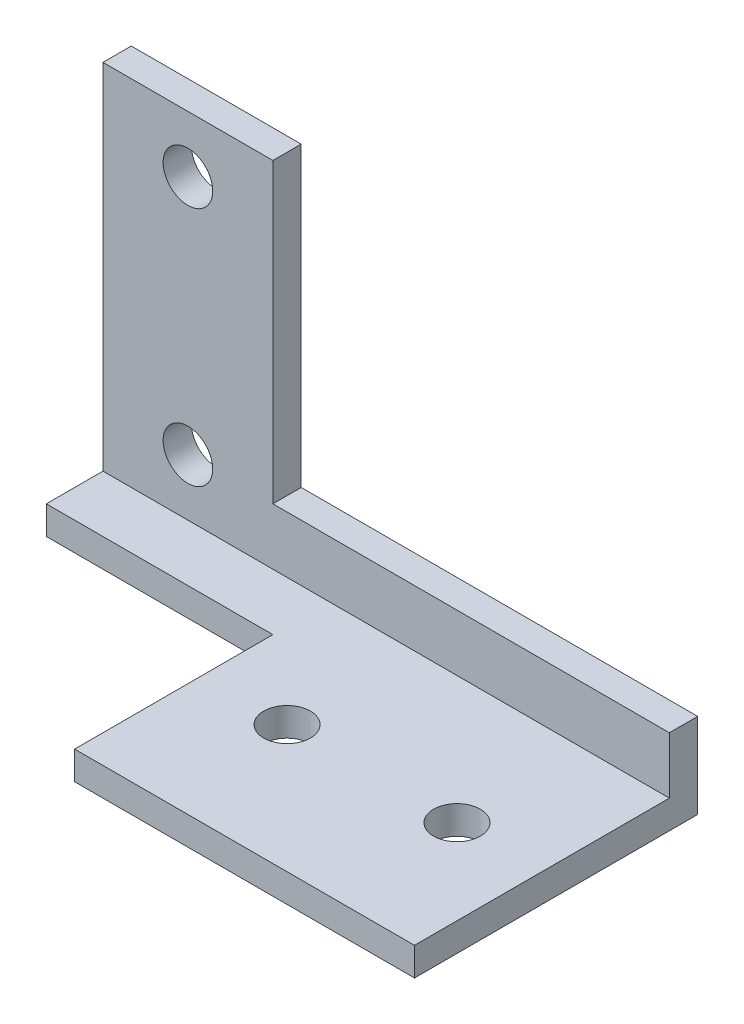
ISO-10303-21;
HEADER;
FILE_DESCRIPTION(('STEP AP214'),'2;1');
FILE_NAME('part.step','',(''),(''),'','','');
FILE_SCHEMA(('AUTOMOTIVE_DESIGN { 1 0 10303 214 1 1 1 1 }'));
ENDSEC;
DATA;
#1=APPLICATION_CONTEXT('core data for automotive mechanical design processes');
#2=APPLICATION_PROTOCOL_DEFINITION('international standard','automotive_design',2000,#1);
#3=PRODUCT_CONTEXT('',#1,'mechanical');
#4=PRODUCT('Part','Part','',(#3));
#5=PRODUCT_RELATED_PRODUCT_CATEGORY('part','',(#4));
#6=PRODUCT_DEFINITION_FORMATION('','',#4);
#7=PRODUCT_DEFINITION_CONTEXT('part definition',#1,'design');
#8=PRODUCT_DEFINITION('design','',#6,#7);
#9=PRODUCT_DEFINITION_SHAPE('','',#8);
#10=(LENGTH_UNIT() NAMED_UNIT(*) SI_UNIT(.MILLI.,.METRE.));
#11=(NAMED_UNIT(*) PLANE_ANGLE_UNIT() SI_UNIT($,.RADIAN.));
#12=(NAMED_UNIT(*) SI_UNIT($,.STERADIAN.) SOLID_ANGLE_UNIT());
#13=UNCERTAINTY_MEASURE_WITH_UNIT(LENGTH_MEASURE(1.E-05),#10,'distance_accuracy_value','');
#14=(GEOMETRIC_REPRESENTATION_CONTEXT(3) GLOBAL_UNCERTAINTY_ASSIGNED_CONTEXT((#13)) GLOBAL_UNIT_ASSIGNED_CONTEXT((#10,
#11,#12)) REPRESENTATION_CONTEXT('',''));
#15=CARTESIAN_POINT('',(0.,0.,0.));
#16=DIRECTION('',(0.,0.,1.));
#17=DIRECTION('',(1.,0.,0.));
#18=AXIS2_PLACEMENT_3D('',#15,#16,#17);
#19=CARTESIAN_POINT('',(40.,27.,2.));
#20=DIRECTION('',(0.,-1.,0.));
#21=DIRECTION('',(0.,0.,-1.));
#22=AXIS2_PLACEMENT_3D('',#19,#20,#21);
#23=PLANE('',#22);
#24=DIRECTION('',(-1.,0.,0.));
#25=VECTOR('',#24,1.);
#26=CARTESIAN_POINT('',(40.,27.,2.));
#27=LINE('',#26,#25);
#28=CARTESIAN_POINT('',(12.,27.,2.));
#29=VERTEX_POINT('',#28);
#30=CARTESIAN_POINT('',(0.,27.,2.));
#31=VERTEX_POINT('',#30);
#32=EDGE_CURVE('E139',#29,#31,#27,.T.);
#33=ORIENTED_EDGE('',*,*,#32,.F.);
#34=DIRECTION('',(0.,0.,1.));
#35=VECTOR('',#34,1.);
#36=CARTESIAN_POINT('',(12.,27.,-38.));
#37=LINE('',#36,#35);
#38=CARTESIAN_POINT('',(12.,27.,0.));
#39=VERTEX_POINT('',#38);
#40=EDGE_CURVE('E173',#39,#29,#37,.T.);
#41=ORIENTED_EDGE('',*,*,#40,.F.);
#42=DIRECTION('',(-1.,0.,0.));
#43=VECTOR('',#42,1.);
#44=CARTESIAN_POINT('',(40.,27.,0.));
#45=LINE('',#44,#43);
#46=CARTESIAN_POINT('',(0.,27.,0.));
#47=VERTEX_POINT('',#46);
#48=EDGE_CURVE('E192',#39,#47,#45,.T.);
#49=ORIENTED_EDGE('',*,*,#48,.T.);
#50=DIRECTION('',(0.,0.,1.));
#51=VECTOR('',#50,1.);
#52=CARTESIAN_POINT('',(0.,27.,2.));
#53=LINE('',#52,#51);
#54=EDGE_CURVE('E180',#47,#31,#53,.T.);
#55=ORIENTED_EDGE('',*,*,#54,.T.);
#56=EDGE_LOOP('',(#33,#41,#49,#55));
#57=FACE_BOUND('',#56,.T.);
#58=ADVANCED_FACE('F35',(#57),#23,.F.);
#59=CARTESIAN_POINT('',(40.,1.99999999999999,2.));
#60=DIRECTION('',(0.,0.,-1.));
#61=DIRECTION('',(0.,1.,0.));
#62=AXIS2_PLACEMENT_3D('',#59,#60,#61);
#63=PLANE('',#62);
#64=CARTESIAN_POINT('',(6.,6.,2.));
#65=DIRECTION('',(0.,0.,1.));
#66=DIRECTION('',(1.,0.,0.));
#67=AXIS2_PLACEMENT_3D('',#64,#65,#66);
#68=CIRCLE('',#67,1.75);
#69=CARTESIAN_POINT('',(7.75,6.,2.));
#70=VERTEX_POINT('',#69);
#71=EDGE_CURVE('E160',#70,#70,#68,.T.);
#72=ORIENTED_EDGE('',*,*,#71,.F.);
#73=EDGE_LOOP('',(#72));
#74=FACE_BOUND('',#73,.T.);
#75=CARTESIAN_POINT('',(6.,23.,2.));
#76=DIRECTION('',(0.,0.,1.));
#77=DIRECTION('',(1.,0.,0.));
#78=AXIS2_PLACEMENT_3D('',#75,#76,#77);
#79=CIRCLE('',#78,1.75);
#80=CARTESIAN_POINT('',(7.75,23.,2.));
#81=VERTEX_POINT('',#80);
#82=EDGE_CURVE('E152',#81,#81,#79,.T.);
#83=ORIENTED_EDGE('',*,*,#82,.F.);
#84=EDGE_LOOP('',(#83));
#85=FACE_BOUND('',#84,.T.);
#86=DIRECTION('',(0.,-1.,0.));
#87=VECTOR('',#86,1.);
#88=CARTESIAN_POINT('',(40.,1.99999999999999,2.));
#89=LINE('',#88,#87);
#90=CARTESIAN_POINT('',(40.,5.99999999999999,2.));
#91=VERTEX_POINT('',#90);
#92=CARTESIAN_POINT('',(40.,1.99999999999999,2.));
#93=VERTEX_POINT('',#92);
#94=EDGE_CURVE('E181',#91,#93,#89,.T.);
#95=ORIENTED_EDGE('',*,*,#94,.F.);
#96=DIRECTION('',(1.,0.,0.));
#97=VECTOR('',#96,1.);
#98=CARTESIAN_POINT('',(40.,6.,2.));
#99=LINE('',#98,#97);
#100=CARTESIAN_POINT('',(12.,5.99999999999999,2.));
#101=VERTEX_POINT('',#100);
#102=EDGE_CURVE('E59',#101,#91,#99,.T.);
#103=ORIENTED_EDGE('',*,*,#102,.F.);
#104=DIRECTION('',(0.,-1.,0.));
#105=VECTOR('',#104,1.);
#106=CARTESIAN_POINT('',(12.,27.,2.));
#107=LINE('',#106,#105);
#108=EDGE_CURVE('E169',#29,#101,#107,.T.);
#109=ORIENTED_EDGE('',*,*,#108,.F.);
#110=ORIENTED_EDGE('',*,*,#32,.T.);
#111=DIRECTION('',(0.,-1.,0.));
#112=VECTOR('',#111,1.);
#113=CARTESIAN_POINT('',(0.,1.99999999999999,2.));
#114=LINE('',#113,#112);
#115=CARTESIAN_POINT('',(0.,1.99999999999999,2.));
#116=VERTEX_POINT('',#115);
#117=EDGE_CURVE('E195',#31,#116,#114,.T.);
#118=ORIENTED_EDGE('',*,*,#117,.T.);
#119=DIRECTION('',(-1.,0.,0.));
#120=VECTOR('',#119,1.);
#121=CARTESIAN_POINT('',(40.,1.99999999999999,2.));
#122=LINE('',#121,#120);
#123=EDGE_CURVE('E135',#93,#116,#122,.T.);
#124=ORIENTED_EDGE('',*,*,#123,.F.);
#125=EDGE_LOOP('',(#95,#103,#109,#110,#118,#124));
#126=FACE_BOUND('',#125,.T.);
#127=ADVANCED_FACE('F231',(#74,#85,#126),#63,.F.);
#128=CARTESIAN_POINT('',(40.,2.,20.));
#129=DIRECTION('',(0.,-1.,0.));
#130=DIRECTION('',(0.,0.,-1.));
#131=AXIS2_PLACEMENT_3D('',#128,#129,#130);
#132=PLANE('',#131);
#133=CARTESIAN_POINT('',(34.,2.,11.));
#134=DIRECTION('',(0.,1.,0.));
#135=DIRECTION('',(0.,0.,1.));
#136=AXIS2_PLACEMENT_3D('',#133,#134,#135);
#137=CIRCLE('',#136,1.64999999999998);
#138=CARTESIAN_POINT('',(34.,2.,12.65));
#139=VERTEX_POINT('',#138);
#140=EDGE_CURVE('E268',#139,#139,#137,.T.);
#141=ORIENTED_EDGE('',*,*,#140,.F.);
#142=EDGE_LOOP('',(#141));
#143=FACE_BOUND('',#142,.T.);
#144=CARTESIAN_POINT('',(22.,2.,11.));
#145=DIRECTION('',(0.,1.,0.));
#146=DIRECTION('',(0.,0.,1.));
#147=AXIS2_PLACEMENT_3D('',#144,#145,#146);
#148=CIRCLE('',#147,1.64999999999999);
#149=CARTESIAN_POINT('',(22.,2.,12.65));
#150=VERTEX_POINT('',#149);
#151=EDGE_CURVE('E261',#150,#150,#148,.T.);
#152=ORIENTED_EDGE('',*,*,#151,.F.);
#153=EDGE_LOOP('',(#152));
#154=FACE_BOUND('',#153,.T.);
#155=DIRECTION('',(0.,0.,1.));
#156=VECTOR('',#155,1.);
#157=CARTESIAN_POINT('',(0.,2.,20.));
#158=LINE('',#157,#156);
#159=CARTESIAN_POINT('',(0.,2.,6.00000000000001));
#160=VERTEX_POINT('',#159);
#161=EDGE_CURVE('E197',#116,#160,#158,.T.);
#162=ORIENTED_EDGE('',*,*,#161,.T.);
#163=DIRECTION('',(-1.,0.,0.));
#164=VECTOR('',#163,1.);
#165=CARTESIAN_POINT('',(0.,1.99999999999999,6.00000000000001));
#166=LINE('',#165,#164);
#167=CARTESIAN_POINT('',(16.,1.99999999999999,6.00000000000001));
#168=VERTEX_POINT('',#167);
#169=EDGE_CURVE('E51',#168,#160,#166,.T.);
#170=ORIENTED_EDGE('',*,*,#169,.F.);
#171=DIRECTION('',(0.,0.,-1.));
#172=VECTOR('',#171,1.);
#173=CARTESIAN_POINT('',(16.,2.,20.));
#174=LINE('',#173,#172);
#175=CARTESIAN_POINT('',(16.,2.,20.));
#176=VERTEX_POINT('',#175);
#177=EDGE_CURVE('E117',#176,#168,#174,.T.);
#178=ORIENTED_EDGE('',*,*,#177,.F.);
#179=DIRECTION('',(-1.,0.,0.));
#180=VECTOR('',#179,1.);
#181=CARTESIAN_POINT('',(40.,2.,20.));
#182=LINE('',#181,#180);
#183=CARTESIAN_POINT('',(40.,2.,20.));
#184=VERTEX_POINT('',#183);
#185=EDGE_CURVE('E129',#184,#176,#182,.T.);
#186=ORIENTED_EDGE('',*,*,#185,.F.);
#187=DIRECTION('',(0.,0.,1.));
#188=VECTOR('',#187,1.);
#189=CARTESIAN_POINT('',(40.,2.,20.));
#190=LINE('',#189,#188);
#191=EDGE_CURVE('E183',#93,#184,#190,.T.);
#192=ORIENTED_EDGE('',*,*,#191,.F.);
#193=ORIENTED_EDGE('',*,*,#123,.T.);
#194=EDGE_LOOP('',(#162,#170,#178,#186,#192,#193));
#195=FACE_BOUND('',#194,.T.);
#196=ADVANCED_FACE('F127',(#143,#154,#195),#132,.F.);
#197=CARTESIAN_POINT('',(40.,0.,20.));
#198=DIRECTION('',(0.,0.,-1.));
#199=DIRECTION('',(-1.,0.,0.));
#200=AXIS2_PLACEMENT_3D('',#197,#198,#199);
#201=PLANE('',#200);
#202=ORIENTED_EDGE('',*,*,#185,.T.);
#203=DIRECTION('',(0.,1.,0.));
#204=VECTOR('',#203,1.);
#205=CARTESIAN_POINT('',(16.,-38.,20.));
#206=LINE('',#205,#204);
#207=CARTESIAN_POINT('',(16.,0.,20.));
#208=VERTEX_POINT('',#207);
#209=EDGE_CURVE('E113',#208,#176,#206,.T.);
#210=ORIENTED_EDGE('',*,*,#209,.F.);
#211=DIRECTION('',(-1.,0.,0.));
#212=VECTOR('',#211,1.);
#213=CARTESIAN_POINT('',(40.,0.,20.));
#214=LINE('',#213,#212);
#215=CARTESIAN_POINT('',(40.,0.,20.));
#216=VERTEX_POINT('',#215);
#217=EDGE_CURVE('E136',#216,#208,#214,.T.);
#218=ORIENTED_EDGE('',*,*,#217,.F.);
#219=DIRECTION('',(0.,-1.,0.));
#220=VECTOR('',#219,1.);
#221=CARTESIAN_POINT('',(40.,0.,20.));
#222=LINE('',#221,#220);
#223=EDGE_CURVE('E134',#184,#216,#222,.T.);
#224=ORIENTED_EDGE('',*,*,#223,.F.);
#225=EDGE_LOOP('',(#202,#210,#218,#224));
#226=FACE_BOUND('',#225,.T.);
#227=ADVANCED_FACE('F133',(#226),#201,.F.);
#228=CARTESIAN_POINT('',(40.,0.,0.));
#229=DIRECTION('',(0.,1.,0.));
#230=DIRECTION('',(0.,0.,1.));
#231=AXIS2_PLACEMENT_3D('',#228,#229,#230);
#232=PLANE('',#231);
#233=CARTESIAN_POINT('',(34.,0.,11.));
#234=DIRECTION('',(0.,1.,0.));
#235=DIRECTION('',(0.,0.,1.));
#236=AXIS2_PLACEMENT_3D('',#233,#234,#235);
#237=CIRCLE('',#236,1.65);
#238=CARTESIAN_POINT('',(34.,0.,12.65));
#239=VERTEX_POINT('',#238);
#240=EDGE_CURVE('E264',#239,#239,#237,.T.);
#241=ORIENTED_EDGE('',*,*,#240,.T.);
#242=EDGE_LOOP('',(#241));
#243=FACE_BOUND('',#242,.T.);
#244=CARTESIAN_POINT('',(22.,0.,11.));
#245=DIRECTION('',(0.,1.,0.));
#246=DIRECTION('',(0.,0.,1.));
#247=AXIS2_PLACEMENT_3D('',#244,#245,#246);
#248=CIRCLE('',#247,1.65);
#249=CARTESIAN_POINT('',(22.,0.,12.65));
#250=VERTEX_POINT('',#249);
#251=EDGE_CURVE('E259',#250,#250,#248,.T.);
#252=ORIENTED_EDGE('',*,*,#251,.T.);
#253=EDGE_LOOP('',(#252));
#254=FACE_BOUND('',#253,.T.);
#255=DIRECTION('',(0.,0.,-1.));
#256=VECTOR('',#255,1.);
#257=CARTESIAN_POINT('',(16.,0.,0.));
#258=LINE('',#257,#256);
#259=CARTESIAN_POINT('',(16.,0.,6.00000000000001));
#260=VERTEX_POINT('',#259);
#261=EDGE_CURVE('E11',#208,#260,#258,.T.);
#262=ORIENTED_EDGE('',*,*,#261,.T.);
#263=DIRECTION('',(-1.,0.,0.));
#264=VECTOR('',#263,1.);
#265=CARTESIAN_POINT('',(40.,0.,6.00000000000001));
#266=LINE('',#265,#264);
#267=CARTESIAN_POINT('',(0.,0.,6.00000000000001));
#268=VERTEX_POINT('',#267);
#269=EDGE_CURVE('E165',#260,#268,#266,.T.);
#270=ORIENTED_EDGE('',*,*,#269,.T.);
#271=DIRECTION('',(0.,0.,-1.));
#272=VECTOR('',#271,1.);
#273=CARTESIAN_POINT('',(0.,0.,0.));
#274=LINE('',#273,#272);
#275=CARTESIAN_POINT('',(0.,0.,0.));
#276=VERTEX_POINT('',#275);
#277=EDGE_CURVE('E199',#268,#276,#274,.T.);
#278=ORIENTED_EDGE('',*,*,#277,.T.);
#279=DIRECTION('',(-1.,0.,0.));
#280=VECTOR('',#279,1.);
#281=CARTESIAN_POINT('',(40.,0.,0.));
#282=LINE('',#281,#280);
#283=CARTESIAN_POINT('',(40.,0.,0.));
#284=VERTEX_POINT('',#283);
#285=EDGE_CURVE('E141',#284,#276,#282,.T.);
#286=ORIENTED_EDGE('',*,*,#285,.F.);
#287=DIRECTION('',(0.,0.,-1.));
#288=VECTOR('',#287,1.);
#289=CARTESIAN_POINT('',(40.,0.,0.));
#290=LINE('',#289,#288);
#291=EDGE_CURVE('E187',#216,#284,#290,.T.);
#292=ORIENTED_EDGE('',*,*,#291,.F.);
#293=ORIENTED_EDGE('',*,*,#217,.T.);
#294=EDGE_LOOP('',(#262,#270,#278,#286,#292,#293));
#295=FACE_BOUND('',#294,.T.);
#296=ADVANCED_FACE('F232',(#243,#254,#295),#232,.F.);
#297=CARTESIAN_POINT('',(40.,27.,0.));
#298=DIRECTION('',(0.,0.,1.));
#299=DIRECTION('',(0.,-1.,0.));
#300=AXIS2_PLACEMENT_3D('',#297,#298,#299);
#301=PLANE('',#300);
#302=CARTESIAN_POINT('',(6.,6.,0.));
#303=DIRECTION('',(0.,0.,1.));
#304=DIRECTION('',(0.,-1.,0.));
#305=AXIS2_PLACEMENT_3D('',#302,#303,#304);
#306=CIRCLE('',#305,1.75);
#307=CARTESIAN_POINT('',(6.,4.25,0.));
#308=VERTEX_POINT('',#307);
#309=EDGE_CURVE('E38',#308,#308,#306,.T.);
#310=ORIENTED_EDGE('',*,*,#309,.T.);
#311=EDGE_LOOP('',(#310));
#312=FACE_BOUND('',#311,.T.);
#313=CARTESIAN_POINT('',(6.,23.,0.));
#314=DIRECTION('',(0.,0.,1.));
#315=DIRECTION('',(0.,-1.,0.));
#316=AXIS2_PLACEMENT_3D('',#313,#314,#315);
#317=CIRCLE('',#316,1.75);
#318=CARTESIAN_POINT('',(6.,21.25,0.));
#319=VERTEX_POINT('',#318);
#320=EDGE_CURVE('E131',#319,#319,#317,.T.);
#321=ORIENTED_EDGE('',*,*,#320,.T.);
#322=EDGE_LOOP('',(#321));
#323=FACE_BOUND('',#322,.T.);
#324=DIRECTION('',(0.,-1.,0.));
#325=VECTOR('',#324,1.);
#326=CARTESIAN_POINT('',(12.,27.,0.));
#327=LINE('',#326,#325);
#328=CARTESIAN_POINT('',(12.,5.99999999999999,0.));
#329=VERTEX_POINT('',#328);
#330=EDGE_CURVE('E148',#39,#329,#327,.T.);
#331=ORIENTED_EDGE('',*,*,#330,.T.);
#332=DIRECTION('',(1.,0.,0.));
#333=VECTOR('',#332,1.);
#334=CARTESIAN_POINT('',(40.,6.,0.));
#335=LINE('',#334,#333);
#336=CARTESIAN_POINT('',(40.,6.,0.));
#337=VERTEX_POINT('',#336);
#338=EDGE_CURVE('E176',#329,#337,#335,.T.);
#339=ORIENTED_EDGE('',*,*,#338,.T.);
#340=DIRECTION('',(0.,1.,0.));
#341=VECTOR('',#340,1.);
#342=CARTESIAN_POINT('',(40.,27.,0.));
#343=LINE('',#342,#341);
#344=EDGE_CURVE('E189',#284,#337,#343,.T.);
#345=ORIENTED_EDGE('',*,*,#344,.F.);
#346=ORIENTED_EDGE('',*,*,#285,.T.);
#347=DIRECTION('',(0.,1.,0.));
#348=VECTOR('',#347,1.);
#349=CARTESIAN_POINT('',(0.,27.,0.));
#350=LINE('',#349,#348);
#351=EDGE_CURVE('E184',#276,#47,#350,.T.);
#352=ORIENTED_EDGE('',*,*,#351,.T.);
#353=ORIENTED_EDGE('',*,*,#48,.F.);
#354=EDGE_LOOP('',(#331,#339,#345,#346,#352,#353));
#355=FACE_BOUND('',#354,.T.);
#356=ADVANCED_FACE('F208',(#312,#323,#355),#301,.F.);
#357=CARTESIAN_POINT('',(40.,27.,0.));
#358=DIRECTION('',(-1.,0.,0.));
#359=DIRECTION('',(0.,0.,1.));
#360=AXIS2_PLACEMENT_3D('',#357,#358,#359);
#361=PLANE('',#360);
#362=ORIENTED_EDGE('',*,*,#344,.T.);
#363=DIRECTION('',(0.,0.,1.));
#364=VECTOR('',#363,1.);
#365=CARTESIAN_POINT('',(40.,6.,0.));
#366=LINE('',#365,#364);
#367=EDGE_CURVE('E146',#337,#91,#366,.T.);
#368=ORIENTED_EDGE('',*,*,#367,.T.);
#369=ORIENTED_EDGE('',*,*,#94,.T.);
#370=ORIENTED_EDGE('',*,*,#191,.T.);
#371=ORIENTED_EDGE('',*,*,#223,.T.);
#372=ORIENTED_EDGE('',*,*,#291,.T.);
#373=EDGE_LOOP('',(#362,#368,#369,#370,#371,#372));
#374=FACE_BOUND('',#373,.T.);
#375=ADVANCED_FACE('F228',(#374),#361,.F.);
#376=CARTESIAN_POINT('',(0.,27.,0.));
#377=DIRECTION('',(-1.,0.,0.));
#378=DIRECTION('',(0.,0.,1.));
#379=AXIS2_PLACEMENT_3D('',#376,#377,#378);
#380=PLANE('',#379);
#381=DIRECTION('',(0.,-1.,0.));
#382=VECTOR('',#381,1.);
#383=CARTESIAN_POINT('',(0.,27.,6.));
#384=LINE('',#383,#382);
#385=EDGE_CURVE('E43',#160,#268,#384,.T.);
#386=ORIENTED_EDGE('',*,*,#385,.F.);
#387=ORIENTED_EDGE('',*,*,#161,.F.);
#388=ORIENTED_EDGE('',*,*,#117,.F.);
#389=ORIENTED_EDGE('',*,*,#54,.F.);
#390=ORIENTED_EDGE('',*,*,#351,.F.);
#391=ORIENTED_EDGE('',*,*,#277,.F.);
#392=EDGE_LOOP('',(#386,#387,#388,#389,#390,#391));
#393=FACE_BOUND('',#392,.T.);
#394=ADVANCED_FACE('F215',(#393),#380,.T.);
#395=CARTESIAN_POINT('',(12.,27.,-38.));
#396=DIRECTION('',(-1.,0.,0.));
#397=DIRECTION('',(0.,-1.,0.));
#398=AXIS2_PLACEMENT_3D('',#395,#396,#397);
#399=PLANE('',#398);
#400=ORIENTED_EDGE('',*,*,#40,.T.);
#401=ORIENTED_EDGE('',*,*,#108,.T.);
#402=DIRECTION('',(0.,0.,1.));
#403=VECTOR('',#402,1.);
#404=CARTESIAN_POINT('',(12.,5.99999999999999,-38.));
#405=LINE('',#404,#403);
#406=EDGE_CURVE('E174',#329,#101,#405,.T.);
#407=ORIENTED_EDGE('',*,*,#406,.F.);
#408=ORIENTED_EDGE('',*,*,#330,.F.);
#409=EDGE_LOOP('',(#400,#401,#407,#408));
#410=FACE_BOUND('',#409,.T.);
#411=ADVANCED_FACE('F223',(#410),#399,.F.);
#412=CARTESIAN_POINT('',(40.,6.,-38.));
#413=DIRECTION('',(0.,-1.,0.));
#414=DIRECTION('',(1.,0.,0.));
#415=AXIS2_PLACEMENT_3D('',#412,#413,#414);
#416=PLANE('',#415);
#417=ORIENTED_EDGE('',*,*,#406,.T.);
#418=ORIENTED_EDGE('',*,*,#102,.T.);
#419=ORIENTED_EDGE('',*,*,#367,.F.);
#420=ORIENTED_EDGE('',*,*,#338,.F.);
#421=EDGE_LOOP('',(#417,#418,#419,#420));
#422=FACE_BOUND('',#421,.T.);
#423=ADVANCED_FACE('F225',(#422),#416,.F.);
#424=CARTESIAN_POINT('',(16.,-38.,20.));
#425=DIRECTION('',(1.,0.,0.));
#426=DIRECTION('',(0.,0.,-1.));
#427=AXIS2_PLACEMENT_3D('',#424,#425,#426);
#428=PLANE('',#427);
#429=ORIENTED_EDGE('',*,*,#209,.T.);
#430=ORIENTED_EDGE('',*,*,#177,.T.);
#431=DIRECTION('',(0.,1.,0.));
#432=VECTOR('',#431,1.);
#433=CARTESIAN_POINT('',(16.,-38.,6.00000000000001));
#434=LINE('',#433,#432);
#435=EDGE_CURVE('E122',#260,#168,#434,.T.);
#436=ORIENTED_EDGE('',*,*,#435,.F.);
#437=ORIENTED_EDGE('',*,*,#261,.F.);
#438=EDGE_LOOP('',(#429,#430,#436,#437));
#439=FACE_BOUND('',#438,.T.);
#440=ADVANCED_FACE('F115',(#439),#428,.F.);
#441=CARTESIAN_POINT('',(0.,-38.,6.00000000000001));
#442=DIRECTION('',(0.,0.,-1.));
#443=DIRECTION('',(0.,1.,0.));
#444=AXIS2_PLACEMENT_3D('',#441,#442,#443);
#445=PLANE('',#444);
#446=ORIENTED_EDGE('',*,*,#435,.T.);
#447=ORIENTED_EDGE('',*,*,#169,.T.);
#448=ORIENTED_EDGE('',*,*,#385,.T.);
#449=ORIENTED_EDGE('',*,*,#269,.F.);
#450=EDGE_LOOP('',(#446,#447,#448,#449));
#451=FACE_BOUND('',#450,.T.);
#452=ADVANCED_FACE('F292',(#451),#445,.F.);
#453=CARTESIAN_POINT('',(6.,23.,-38.));
#454=DIRECTION('',(0.,0.,1.));
#455=DIRECTION('',(1.,0.,0.));
#456=AXIS2_PLACEMENT_3D('',#453,#454,#455);
#457=CYLINDRICAL_SURFACE('',#456,1.75);
#458=ORIENTED_EDGE('',*,*,#82,.T.);
#459=EDGE_LOOP('',(#458));
#460=FACE_BOUND('',#459,.T.);
#461=ORIENTED_EDGE('',*,*,#320,.F.);
#462=EDGE_LOOP('',(#461));
#463=FACE_BOUND('',#462,.T.);
#464=ADVANCED_FACE('F287',(#460,#463),#457,.F.);
#465=CARTESIAN_POINT('',(6.,6.,-38.));
#466=DIRECTION('',(0.,0.,1.));
#467=DIRECTION('',(1.,0.,0.));
#468=AXIS2_PLACEMENT_3D('',#465,#466,#467);
#469=CYLINDRICAL_SURFACE('',#468,1.75);
#470=ORIENTED_EDGE('',*,*,#71,.T.);
#471=EDGE_LOOP('',(#470));
#472=FACE_BOUND('',#471,.T.);
#473=ORIENTED_EDGE('',*,*,#309,.F.);
#474=EDGE_LOOP('',(#473));
#475=FACE_BOUND('',#474,.T.);
#476=ADVANCED_FACE('F278',(#472,#475),#469,.F.);
#477=CARTESIAN_POINT('',(22.,2.,11.));
#478=DIRECTION('',(0.,1.,0.));
#479=DIRECTION('',(0.,0.,1.));
#480=AXIS2_PLACEMENT_3D('',#477,#478,#479);
#481=CYLINDRICAL_SURFACE('',#480,1.64999999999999);
#482=ORIENTED_EDGE('',*,*,#251,.F.);
#483=EDGE_LOOP('',(#482));
#484=FACE_BOUND('',#483,.T.);
#485=ORIENTED_EDGE('',*,*,#151,.T.);
#486=EDGE_LOOP('',(#485));
#487=FACE_BOUND('',#486,.T.);
#488=ADVANCED_FACE('F276',(#484,#487),#481,.F.);
#489=CARTESIAN_POINT('',(34.,2.,11.));
#490=DIRECTION('',(0.,1.,0.));
#491=DIRECTION('',(0.,0.,1.));
#492=AXIS2_PLACEMENT_3D('',#489,#490,#491);
#493=CYLINDRICAL_SURFACE('',#492,1.64999999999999);
#494=ORIENTED_EDGE('',*,*,#240,.F.);
#495=EDGE_LOOP('',(#494));
#496=FACE_BOUND('',#495,.T.);
#497=ORIENTED_EDGE('',*,*,#140,.T.);
#498=EDGE_LOOP('',(#497));
#499=FACE_BOUND('',#498,.T.);
#500=ADVANCED_FACE('F272',(#496,#499),#493,.F.);
#501=CLOSED_SHELL('',(#58,#127,#196,#227,#296,#356,#375,#394,#411,#423,#440,#452,#464,#476,#488,#500));
#502=MANIFOLD_SOLID_BREP('B2',#501);
#503=ADVANCED_BREP_SHAPE_REPRESENTATION('',(#18,#502),#14);
#504=SHAPE_DEFINITION_REPRESENTATION(#9,#503);
ENDSEC;
END-ISO-10303-21;
